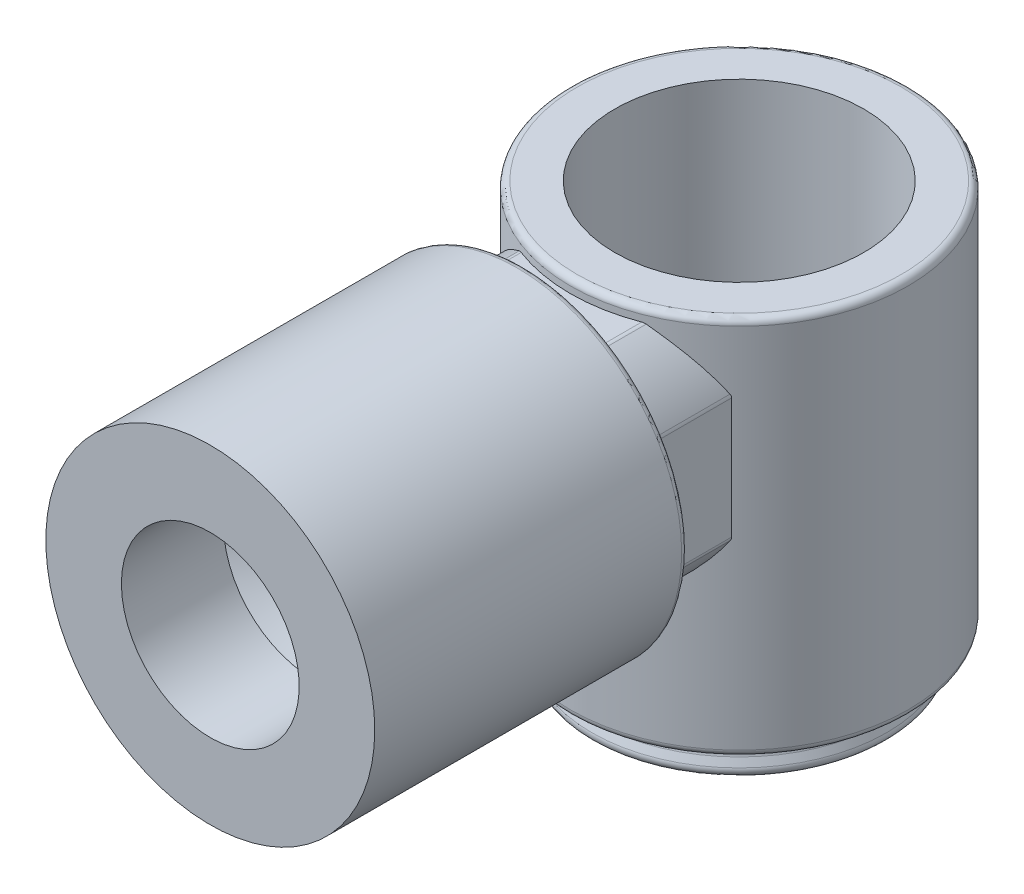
from build123d import *

# Parameters (mm, degrees)
SKETCH1_R           = 4.826
EXTRUDE1_DEPTH      = 11.811
SKETCH2_W           = 5.715741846
SKETCH2_H           = 3.7465
SKETCH4_OUTSIDE_W   = 16.772
SKETCH4_OUTSIDE_H   = 19.947
SKETCH4_OUTSIDE_W_2 = 6.604
SKETCH4_OUTSIDE_H_2 = 6.604
CUT_EXTRUDE1_DEPTH  = 21.401592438
SKETCH6_R           = 3.556
CUT_EXTRUDE2_DEPTH  = 20.778593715
FILLET1_R           = 0.1905


with BuildPart() as part:
    # Sketch1 → Extrude1 (new body)
    with BuildSketch(Plane(origin=(0, 0, 0), x_dir=(1, 0, 0), z_dir=(0, 1, 0))):
        with Locations(Location((0, 0, 0), (0, 0, 270))):
            Circle(SKETCH1_R)
    extrude(amount=EXTRUDE1_DEPTH)


with BuildPart() as body_2:
    # Sketch2 → Revolve1 (revolve)
    with BuildSketch(Plane(origin=(0, 0, 0), x_dir=(0, 0, -1), z_dir=(1, 0, 0)), mode=Mode.PRIVATE) as revolve1_sk:
        with Locations((-5.196128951, 10.00125)):
            Rectangle(SKETCH2_W, SKETCH2_H)
    revolve(revolve1_sk.sketch.rotate(Axis((0, 8.128, 8.053999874), (0, 0, -1)), 90), axis=Axis((0, 8.128, 8.053999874), (0, 0, -1)))

    # Sketch4 outside → Cut-Extrude1 (cut, through all)
    with BuildSketch(Plane.XY):
        with Locations((0, 6.4135)):
            Rectangle(SKETCH4_OUTSIDE_W, SKETCH4_OUTSIDE_H)
        with Locations((0, 8.128)):
            Rectangle(SKETCH4_OUTSIDE_W_2, SKETCH4_OUTSIDE_H_2, mode=Mode.SUBTRACT)
    extrude(amount=CUT_EXTRUDE1_DEPTH, mode=Mode.SUBTRACT)


with BuildPart() as body_3:
    # Sketch3 → Revolve2 (revolve)
    with BuildSketch(Plane(origin=(0, 0, 0), x_dir=(0, 0, -1), z_dir=(1, 0, 0)), mode=Mode.PRIVATE) as revolve2_sk:
        Polygon((-15.113, 12.827), (-6.223, 12.827), (-4.031820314, 8.128), (-6.223, 8.128), (-15.113, 8.128), align=None)
    revolve(revolve2_sk.sketch.rotate(Axis((0, 8.128, 15.113), (0, 0, -1)), 90), axis=Axis((0, 8.128, 15.113), (0, 0, -1)))


with BuildPart() as part_1:
    add(part.part)

    # Combine1: union body 3, body 2
    add(body_3.part)
    add(body_2.part)

    # Sketch5 → Cut-Revolve1 (revolve, cut)
    with BuildSketch(Plane(origin=(0, 0, 0), x_dir=(0, 0, -1), z_dir=(1, 0, 0)), mode=Mode.PRIVATE) as cut_revolve1_sk:
        Polygon((0, 8.128), (-16.005535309, 8.128), (-16.005535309, 10.668), (-12.195535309, 10.668), (-11.603324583, 9.398), (0, 9.398), align=None)
    revolve(cut_revolve1_sk.sketch.rotate(Axis((0, 8.128, 0), (0, 0, 1)), 90), axis=Axis((0, 8.128, 0), (0, 0, 1)), mode=Mode.SUBTRACT)

    # Sketch6 → Cut-Extrude2 (cut, through all)
    with BuildSketch(Plane(origin=(0, 11.811, 0), x_dir=(-1, 0, 0), z_dir=(0, 1, 0))):
        with Locations(Location((0, 0, 0), (0, 0, 90))):
            Circle(SKETCH6_R)
    extrude(amount=-CUT_EXTRUDE2_DEPTH, mode=Mode.SUBTRACT)

    # Sketch7 → Cut-Revolve2 (revolve, cut)
    with BuildSketch(Plane.XY, mode=Mode.PRIVATE) as cut_revolve2_sk:
        Polygon((4.826, 1.016), (4.064, 0.635), (4.318, 0), (5.74362723, 0), (5.74362723, 1.016), align=None)
    revolve(cut_revolve2_sk.sketch.rotate(Axis((0, 11.811, 0), (0, -1, 0)), 90), axis=Axis((0, 11.811, 0), (0, -1, 0)), mode=Mode.SUBTRACT)

    # Fillet1
    fillet1_edges = [part_1.edges().sort_by_distance(p)[0] for p in [
        (-3.302, 6.357955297, 4.649184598),
        (-1.770044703, 4.826, 5.13426049),
        (1.770044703, 4.826, 5.13426049),
        (3.302, 6.357955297, 4.649184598),
        (3.302, 9.898044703, 4.649184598),
        (1.770044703, 11.43, 5.13426049),
        (-4.699, 8.128, 6.223),
        (0, 11.811, -4.826),
        (0, 0, -4.318),
        (0, 0.635, -4.064),
        (0, 1.016, -4.826),
        (-1.770044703, 11.43, 5.13426049),
        (-3.302, 9.898044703, 4.649184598),
    ]]
    fillet(fillet1_edges, radius=FILLET1_R)


solid = part_1.part
